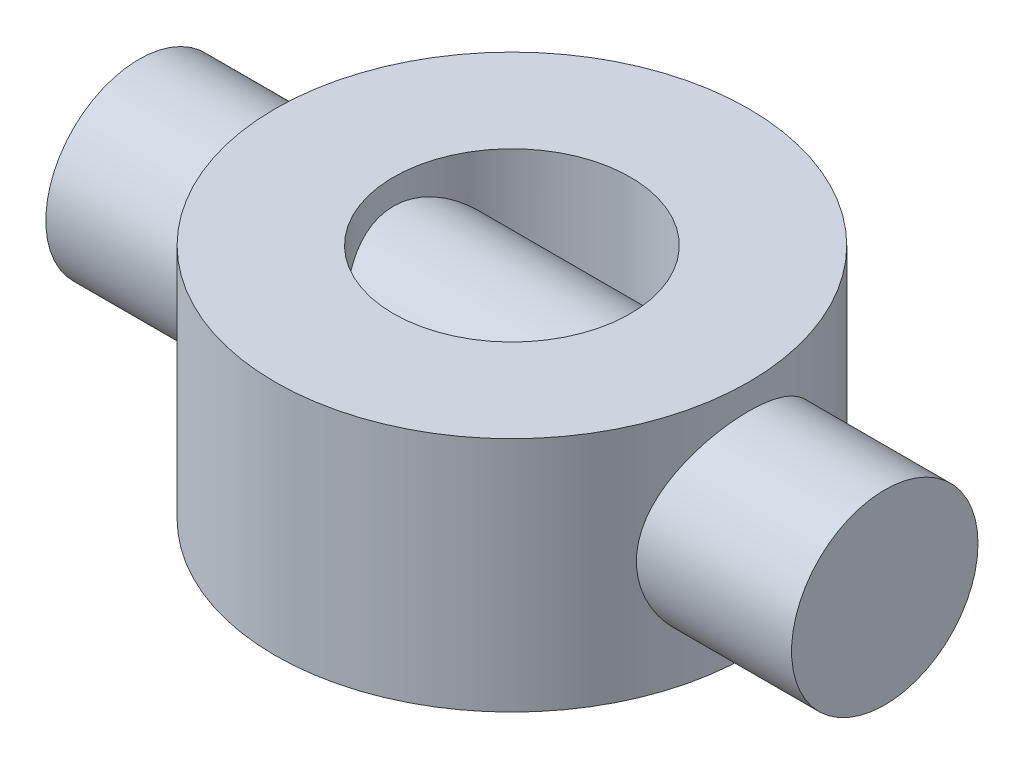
from build123d import *

# Parameters (mm, degrees)
BOSS_EXTRUDE1_DEPTH      = 40
BOSS_EXTRUDE1_DEPTH_BACK = 40
SKETCH2_R                = 10
BOSS_EXTRUDE2_DEPTH      = 12.7
BOSS_EXTRUDE2_DEPTH_BACK = 12.7
SKETCH1_R                = 25.4
SKETCH1_R_2              = 12.7


with BuildPart() as part:
    # Sketch2 → Boss-Extrude1 (new, two sides: drawn at the far end of the back side and taken through both)
    with BuildSketch(Plane(origin=(0, 0, 0), x_dir=(0, 0, -1), z_dir=(1, 0, 0)).offset(-BOSS_EXTRUDE1_DEPTH_BACK)):
        Circle(SKETCH2_R)
    extrude(amount=BOSS_EXTRUDE1_DEPTH + BOSS_EXTRUDE1_DEPTH_BACK)

    # Sketch1 → Boss-Extrude2 (add, two sides: drawn at the far end of the back side and taken through both)
    with BuildSketch(Plane(origin=(0, 0, 0), x_dir=(1, 0, 0), z_dir=(0, 1, 0)).offset(-BOSS_EXTRUDE2_DEPTH_BACK)):
        with Locations(Location((0, 0, 0), (0, 0, 270))):
            Circle(SKETCH1_R)
        with Locations(Location((0, 0, 0), (0, 0, 270))):
            Circle(SKETCH1_R_2, mode=Mode.SUBTRACT)
    extrude(amount=BOSS_EXTRUDE2_DEPTH + BOSS_EXTRUDE2_DEPTH_BACK)


solid = part.part
